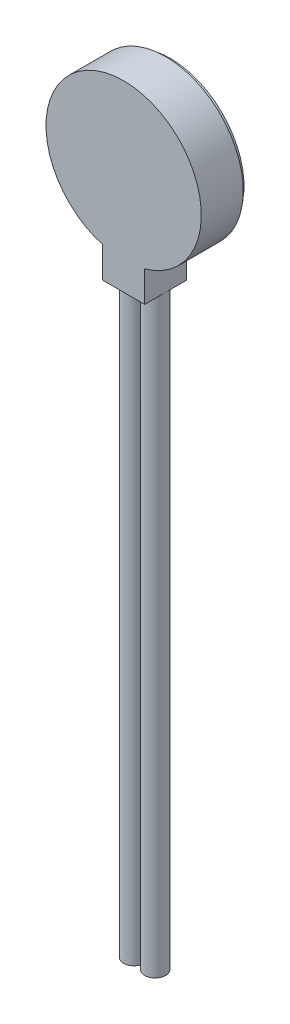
ISO-10303-21;
HEADER;
FILE_DESCRIPTION(('STEP AP214'),'2;1');
FILE_NAME('part.step','',(''),(''),'','','');
FILE_SCHEMA(('AUTOMOTIVE_DESIGN { 1 0 10303 214 1 1 1 1 }'));
ENDSEC;
DATA;
#1=APPLICATION_CONTEXT('core data for automotive mechanical design processes');
#2=APPLICATION_PROTOCOL_DEFINITION('international standard','automotive_design',2000,#1);
#3=PRODUCT_CONTEXT('',#1,'mechanical');
#4=PRODUCT('Part','Part','',(#3));
#5=PRODUCT_RELATED_PRODUCT_CATEGORY('part','',(#4));
#6=PRODUCT_DEFINITION_FORMATION('','',#4);
#7=PRODUCT_DEFINITION_CONTEXT('part definition',#1,'design');
#8=PRODUCT_DEFINITION('design','',#6,#7);
#9=PRODUCT_DEFINITION_SHAPE('','',#8);
#10=(LENGTH_UNIT() NAMED_UNIT(*) SI_UNIT(.MILLI.,.METRE.));
#11=(NAMED_UNIT(*) PLANE_ANGLE_UNIT() SI_UNIT($,.RADIAN.));
#12=(NAMED_UNIT(*) SI_UNIT($,.STERADIAN.) SOLID_ANGLE_UNIT());
#13=UNCERTAINTY_MEASURE_WITH_UNIT(LENGTH_MEASURE(1.E-05),#10,'distance_accuracy_value','');
#14=(GEOMETRIC_REPRESENTATION_CONTEXT(3) GLOBAL_UNCERTAINTY_ASSIGNED_CONTEXT((#13)) GLOBAL_UNIT_ASSIGNED_CONTEXT((#10,
#11,#12)) REPRESENTATION_CONTEXT('',''));
#15=CARTESIAN_POINT('',(0.,0.,0.));
#16=DIRECTION('',(0.,0.,1.));
#17=DIRECTION('',(1.,0.,0.));
#18=AXIS2_PLACEMENT_3D('',#15,#16,#17);
#19=CARTESIAN_POINT('',(0.,0.,2.7));
#20=DIRECTION('',(0.,0.,-1.));
#21=DIRECTION('',(-1.,0.,0.));
#22=AXIS2_PLACEMENT_3D('',#19,#20,#21);
#23=CYLINDRICAL_SURFACE('',#22,5.);
#24=CARTESIAN_POINT('',(0.,0.,0.));
#25=DIRECTION('',(0.,0.,1.));
#26=DIRECTION('',(1.,0.,0.));
#27=AXIS2_PLACEMENT_3D('',#24,#25,#26);
#28=CIRCLE('',#27,5.);
#29=CARTESIAN_POINT('',(1.3499975,-4.81430231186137,0.));
#30=VERTEX_POINT('',#29);
#31=CARTESIAN_POINT('',(-1.3499975,-4.81430231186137,0.));
#32=VERTEX_POINT('',#31);
#33=EDGE_CURVE('E38',#30,#32,#28,.T.);
#34=ORIENTED_EDGE('',*,*,#33,.T.);
#35=DIRECTION('',(0.,0.,-1.));
#36=VECTOR('',#35,1.);
#37=CARTESIAN_POINT('',(-1.3499975,-4.81430231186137,2.7));
#38=LINE('',#37,#36);
#39=CARTESIAN_POINT('',(-1.3499975,-4.81430231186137,2.7));
#40=VERTEX_POINT('',#39);
#41=EDGE_CURVE('E115',#32,#40,#38,.F.);
#42=ORIENTED_EDGE('',*,*,#41,.T.);
#43=CARTESIAN_POINT('',(0.,0.,2.7));
#44=DIRECTION('',(0.,0.,1.));
#45=DIRECTION('',(1.,0.,0.));
#46=AXIS2_PLACEMENT_3D('',#43,#44,#45);
#47=CIRCLE('',#46,5.);
#48=CARTESIAN_POINT('',(1.3499975,-4.81430231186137,2.7));
#49=VERTEX_POINT('',#48);
#50=EDGE_CURVE('E43',#49,#40,#47,.T.);
#51=ORIENTED_EDGE('',*,*,#50,.F.);
#52=DIRECTION('',(0.,0.,-1.));
#53=VECTOR('',#52,1.);
#54=CARTESIAN_POINT('',(1.3499975,-4.81430231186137,2.7));
#55=LINE('',#54,#53);
#56=EDGE_CURVE('E108',#49,#30,#55,.T.);
#57=ORIENTED_EDGE('',*,*,#56,.T.);
#58=EDGE_LOOP('',(#34,#42,#51,#57));
#59=FACE_BOUND('',#58,.T.);
#60=ADVANCED_FACE('F35',(#59),#23,.T.);
#61=CARTESIAN_POINT('',(0.,0.,2.7));
#62=DIRECTION('',(0.,0.,1.));
#63=DIRECTION('',(1.,0.,0.));
#64=AXIS2_PLACEMENT_3D('',#61,#62,#63);
#65=PLANE('',#64);
#66=ORIENTED_EDGE('',*,*,#50,.T.);
#67=DIRECTION('',(0.,1.,0.));
#68=VECTOR('',#67,1.);
#69=CARTESIAN_POINT('',(-1.3499975,-6.8,2.7));
#70=LINE('',#69,#68);
#71=CARTESIAN_POINT('',(-1.3499975,-6.8,2.7));
#72=VERTEX_POINT('',#71);
#73=EDGE_CURVE('E59',#72,#40,#70,.T.);
#74=ORIENTED_EDGE('',*,*,#73,.F.);
#75=DIRECTION('',(1.,0.,0.));
#76=VECTOR('',#75,1.);
#77=CARTESIAN_POINT('',(-1.3499975,-6.8,2.7));
#78=LINE('',#77,#76);
#79=CARTESIAN_POINT('',(1.3499975,-6.8,2.7));
#80=VERTEX_POINT('',#79);
#81=EDGE_CURVE('E99',#72,#80,#78,.T.);
#82=ORIENTED_EDGE('',*,*,#81,.T.);
#83=DIRECTION('',(0.,1.,0.));
#84=VECTOR('',#83,1.);
#85=CARTESIAN_POINT('',(1.3499975,-6.8,2.7));
#86=LINE('',#85,#84);
#87=EDGE_CURVE('E51',#80,#49,#86,.T.);
#88=ORIENTED_EDGE('',*,*,#87,.T.);
#89=EDGE_LOOP('',(#66,#74,#82,#88));
#90=FACE_BOUND('',#89,.T.);
#91=ADVANCED_FACE('F158',(#90),#65,.T.);
#92=CARTESIAN_POINT('',(0.,0.,0.));
#93=DIRECTION('',(0.,0.,1.));
#94=DIRECTION('',(1.,0.,0.));
#95=AXIS2_PLACEMENT_3D('',#92,#93,#94);
#96=PLANE('',#95);
#97=ORIENTED_EDGE('',*,*,#33,.F.);
#98=DIRECTION('',(0.,1.,0.));
#99=VECTOR('',#98,1.);
#100=CARTESIAN_POINT('',(1.3499975,-6.8,0.));
#101=LINE('',#100,#99);
#102=CARTESIAN_POINT('',(1.3499975,-6.8,0.));
#103=VERTEX_POINT('',#102);
#104=EDGE_CURVE('E109',#103,#30,#101,.T.);
#105=ORIENTED_EDGE('',*,*,#104,.F.);
#106=DIRECTION('',(-1.,0.,0.));
#107=VECTOR('',#106,1.);
#108=CARTESIAN_POINT('',(-1.3499975,-6.8,0.));
#109=LINE('',#108,#107);
#110=CARTESIAN_POINT('',(-1.3499975,-6.8,0.));
#111=VERTEX_POINT('',#110);
#112=EDGE_CURVE('E91',#103,#111,#109,.T.);
#113=ORIENTED_EDGE('',*,*,#112,.T.);
#114=DIRECTION('',(0.,1.,0.));
#115=VECTOR('',#114,1.);
#116=CARTESIAN_POINT('',(-1.3499975,-6.8,0.));
#117=LINE('',#116,#115);
#118=EDGE_CURVE('E105',#111,#32,#117,.T.);
#119=ORIENTED_EDGE('',*,*,#118,.T.);
#120=EDGE_LOOP('',(#97,#105,#113,#119));
#121=FACE_BOUND('',#120,.T.);
#122=CARTESIAN_POINT('',(0.,0.,0.));
#123=DIRECTION('',(0.,0.,-1.));
#124=DIRECTION('',(-1.,0.,0.));
#125=AXIS2_PLACEMENT_3D('',#122,#123,#124);
#126=CIRCLE('',#125,4.75);
#127=CARTESIAN_POINT('',(-4.75,0.,0.));
#128=VERTEX_POINT('',#127);
#129=EDGE_CURVE('E11',#128,#128,#126,.T.);
#130=ORIENTED_EDGE('',*,*,#129,.F.);
#131=EDGE_LOOP('',(#130));
#132=FACE_BOUND('',#131,.T.);
#133=ADVANCED_FACE('F124',(#121,#132),#96,.F.);
#134=CARTESIAN_POINT('',(0.,0.,-0.3));
#135=DIRECTION('',(0.,0.,1.));
#136=DIRECTION('',(1.,0.,0.));
#137=AXIS2_PLACEMENT_3D('',#134,#135,#136);
#138=CYLINDRICAL_SURFACE('',#137,4.75);
#139=CARTESIAN_POINT('',(0.,0.,-0.3));
#140=DIRECTION('',(0.,0.,-1.));
#141=DIRECTION('',(-1.,0.,0.));
#142=AXIS2_PLACEMENT_3D('',#139,#140,#141);
#143=CIRCLE('',#142,4.75);
#144=CARTESIAN_POINT('',(-4.75,0.,-0.3));
#145=VERTEX_POINT('',#144);
#146=EDGE_CURVE('E117',#145,#145,#143,.T.);
#147=ORIENTED_EDGE('',*,*,#146,.F.);
#148=EDGE_LOOP('',(#147));
#149=FACE_BOUND('',#148,.T.);
#150=ORIENTED_EDGE('',*,*,#129,.T.);
#151=EDGE_LOOP('',(#150));
#152=FACE_BOUND('',#151,.T.);
#153=ADVANCED_FACE('F166',(#149,#152),#138,.T.);
#154=CARTESIAN_POINT('',(0.,0.,-0.3));
#155=DIRECTION('',(0.,0.,-1.));
#156=DIRECTION('',(-1.,0.,0.));
#157=AXIS2_PLACEMENT_3D('',#154,#155,#156);
#158=PLANE('',#157);
#159=ORIENTED_EDGE('',*,*,#146,.T.);
#160=EDGE_LOOP('',(#159));
#161=FACE_BOUND('',#160,.T.);
#162=ADVANCED_FACE('F170',(#161),#158,.T.);
#163=CARTESIAN_POINT('',(-1.3499975,-6.8,0.));
#164=DIRECTION('',(-1.,0.,0.));
#165=DIRECTION('',(0.,0.,1.));
#166=AXIS2_PLACEMENT_3D('',#163,#164,#165);
#167=PLANE('',#166);
#168=ORIENTED_EDGE('',*,*,#41,.F.);
#169=ORIENTED_EDGE('',*,*,#118,.F.);
#170=DIRECTION('',(0.,0.,1.));
#171=VECTOR('',#170,1.);
#172=CARTESIAN_POINT('',(-1.3499975,-6.8,0.));
#173=LINE('',#172,#171);
#174=CARTESIAN_POINT('',(-1.3499975,-6.8,1.35));
#175=VERTEX_POINT('',#174);
#176=EDGE_CURVE('E100',#111,#175,#173,.T.);
#177=ORIENTED_EDGE('',*,*,#176,.T.);
#178=EDGE_CURVE('E131',#175,#72,#173,.T.);
#179=ORIENTED_EDGE('',*,*,#178,.T.);
#180=ORIENTED_EDGE('',*,*,#73,.T.);
#181=EDGE_LOOP('',(#168,#169,#177,#179,#180));
#182=FACE_BOUND('',#181,.T.);
#183=ADVANCED_FACE('F126',(#182),#167,.T.);
#184=CARTESIAN_POINT('',(1.3499975,-6.8,0.));
#185=DIRECTION('',(1.,0.,0.));
#186=DIRECTION('',(0.,0.,-1.));
#187=AXIS2_PLACEMENT_3D('',#184,#185,#186);
#188=PLANE('',#187);
#189=ORIENTED_EDGE('',*,*,#56,.F.);
#190=ORIENTED_EDGE('',*,*,#87,.F.);
#191=DIRECTION('',(0.,0.,-1.));
#192=VECTOR('',#191,1.);
#193=CARTESIAN_POINT('',(1.3499975,-6.8,0.));
#194=LINE('',#193,#192);
#195=CARTESIAN_POINT('',(1.3499975,-6.8,1.35));
#196=VERTEX_POINT('',#195);
#197=EDGE_CURVE('E83',#80,#196,#194,.T.);
#198=ORIENTED_EDGE('',*,*,#197,.T.);
#199=EDGE_CURVE('E86',#196,#103,#194,.T.);
#200=ORIENTED_EDGE('',*,*,#199,.T.);
#201=ORIENTED_EDGE('',*,*,#104,.T.);
#202=EDGE_LOOP('',(#189,#190,#198,#200,#201));
#203=FACE_BOUND('',#202,.T.);
#204=ADVANCED_FACE('F85',(#203),#188,.T.);
#205=CARTESIAN_POINT('',(0.,-6.8,0.));
#206=DIRECTION('',(0.,1.,0.));
#207=DIRECTION('',(0.,0.,1.));
#208=AXIS2_PLACEMENT_3D('',#205,#206,#207);
#209=PLANE('',#208);
#210=ORIENTED_EDGE('',*,*,#199,.F.);
#211=CARTESIAN_POINT('',(0.67817375,-6.8,1.35));
#212=DIRECTION('',(0.,-1.,0.));
#213=DIRECTION('',(0.,0.,-1.));
#214=AXIS2_PLACEMENT_3D('',#211,#212,#213);
#215=CIRCLE('',#214,0.67182375);
#216=EDGE_CURVE('E96',#196,#196,#215,.T.);
#217=ORIENTED_EDGE('',*,*,#216,.F.);
#218=ORIENTED_EDGE('',*,*,#197,.F.);
#219=ORIENTED_EDGE('',*,*,#81,.F.);
#220=ORIENTED_EDGE('',*,*,#178,.F.);
#221=CARTESIAN_POINT('',(-0.67817375,-6.8,1.35));
#222=DIRECTION('',(0.,-1.,0.));
#223=DIRECTION('',(0.,0.,-1.));
#224=AXIS2_PLACEMENT_3D('',#221,#222,#223);
#225=CIRCLE('',#224,0.67182375);
#226=EDGE_CURVE('E130',#175,#175,#225,.T.);
#227=ORIENTED_EDGE('',*,*,#226,.F.);
#228=ORIENTED_EDGE('',*,*,#176,.F.);
#229=ORIENTED_EDGE('',*,*,#112,.F.);
#230=EDGE_LOOP('',(#210,#217,#218,#219,#220,#227,#228,#229));
#231=FACE_BOUND('',#230,.T.);
#232=ADVANCED_FACE('F94',(#231),#209,.F.);
#233=CARTESIAN_POINT('',(-0.67817375,-44.9,1.35));
#234=DIRECTION('',(0.,1.,0.));
#235=DIRECTION('',(0.,0.,1.));
#236=AXIS2_PLACEMENT_3D('',#233,#234,#235);
#237=CYLINDRICAL_SURFACE('',#236,0.67182375);
#238=CARTESIAN_POINT('',(-0.67817375,-44.9,1.35));
#239=DIRECTION('',(0.,-1.,0.));
#240=DIRECTION('',(0.,0.,-1.));
#241=AXIS2_PLACEMENT_3D('',#238,#239,#240);
#242=CIRCLE('',#241,0.67182375);
#243=CARTESIAN_POINT('',(-0.67817375,-44.9,0.67817625));
#244=VERTEX_POINT('',#243);
#245=EDGE_CURVE('E132',#244,#244,#242,.T.);
#246=ORIENTED_EDGE('',*,*,#245,.F.);
#247=EDGE_LOOP('',(#246));
#248=FACE_BOUND('',#247,.T.);
#249=ORIENTED_EDGE('',*,*,#226,.T.);
#250=EDGE_LOOP('',(#249));
#251=FACE_BOUND('',#250,.T.);
#252=ADVANCED_FACE('F154',(#248,#251),#237,.T.);
#253=CARTESIAN_POINT('',(-0.67817375,-44.9,1.35));
#254=DIRECTION('',(0.,-1.,0.));
#255=DIRECTION('',(0.,0.,-1.));
#256=AXIS2_PLACEMENT_3D('',#253,#254,#255);
#257=PLANE('',#256);
#258=ORIENTED_EDGE('',*,*,#245,.T.);
#259=EDGE_LOOP('',(#258));
#260=FACE_BOUND('',#259,.T.);
#261=ADVANCED_FACE('F147',(#260),#257,.T.);
#262=CARTESIAN_POINT('',(0.67817375,-44.9,1.35));
#263=DIRECTION('',(0.,1.,0.));
#264=DIRECTION('',(0.,0.,1.));
#265=AXIS2_PLACEMENT_3D('',#262,#263,#264);
#266=CYLINDRICAL_SURFACE('',#265,0.67182375);
#267=CARTESIAN_POINT('',(0.67817375,-44.9,1.35));
#268=DIRECTION('',(0.,-1.,0.));
#269=DIRECTION('',(0.,0.,-1.));
#270=AXIS2_PLACEMENT_3D('',#267,#268,#269);
#271=CIRCLE('',#270,0.67182375);
#272=CARTESIAN_POINT('',(0.67817375,-44.9,0.67817625));
#273=VERTEX_POINT('',#272);
#274=EDGE_CURVE('E135',#273,#273,#271,.T.);
#275=ORIENTED_EDGE('',*,*,#274,.F.);
#276=EDGE_LOOP('',(#275));
#277=FACE_BOUND('',#276,.T.);
#278=ORIENTED_EDGE('',*,*,#216,.T.);
#279=EDGE_LOOP('',(#278));
#280=FACE_BOUND('',#279,.T.);
#281=ADVANCED_FACE('F144',(#277,#280),#266,.T.);
#282=CARTESIAN_POINT('',(0.67817375,-44.9,1.35));
#283=DIRECTION('',(0.,-1.,0.));
#284=DIRECTION('',(0.,0.,-1.));
#285=AXIS2_PLACEMENT_3D('',#282,#283,#284);
#286=PLANE('',#285);
#287=ORIENTED_EDGE('',*,*,#274,.T.);
#288=EDGE_LOOP('',(#287));
#289=FACE_BOUND('',#288,.T.);
#290=ADVANCED_FACE('F142',(#289),#286,.T.);
#291=CLOSED_SHELL('',(#60,#91,#133,#153,#162,#183,#204,#232,#252,#261,#281,#290));
#292=MANIFOLD_SOLID_BREP('B2',#291);
#293=ADVANCED_BREP_SHAPE_REPRESENTATION('',(#18,#292),#14);
#294=SHAPE_DEFINITION_REPRESENTATION(#9,#293);
ENDSEC;
END-ISO-10303-21;
